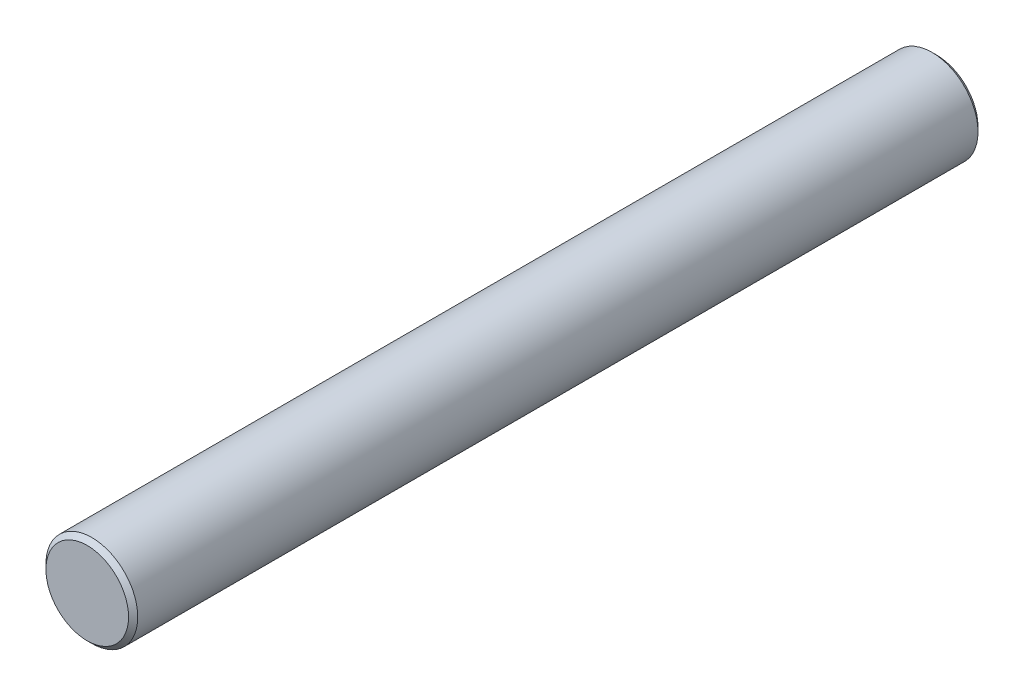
ISO-10303-21;
HEADER;
FILE_DESCRIPTION(('STEP AP214'),'2;1');
FILE_NAME('part.step','',(''),(''),'','','');
FILE_SCHEMA(('AUTOMOTIVE_DESIGN { 1 0 10303 214 1 1 1 1 }'));
ENDSEC;
DATA;
#1=APPLICATION_CONTEXT('core data for automotive mechanical design processes');
#2=APPLICATION_PROTOCOL_DEFINITION('international standard','automotive_design',2000,#1);
#3=PRODUCT_CONTEXT('',#1,'mechanical');
#4=PRODUCT('Part','Part','',(#3));
#5=PRODUCT_RELATED_PRODUCT_CATEGORY('part','',(#4));
#6=PRODUCT_DEFINITION_FORMATION('','',#4);
#7=PRODUCT_DEFINITION_CONTEXT('part definition',#1,'design');
#8=PRODUCT_DEFINITION('design','',#6,#7);
#9=PRODUCT_DEFINITION_SHAPE('','',#8);
#10=(LENGTH_UNIT() NAMED_UNIT(*) SI_UNIT(.MILLI.,.METRE.));
#11=(NAMED_UNIT(*) PLANE_ANGLE_UNIT() SI_UNIT($,.RADIAN.));
#12=(NAMED_UNIT(*) SI_UNIT($,.STERADIAN.) SOLID_ANGLE_UNIT());
#13=UNCERTAINTY_MEASURE_WITH_UNIT(LENGTH_MEASURE(1.E-05),#10,'distance_accuracy_value','');
#14=(GEOMETRIC_REPRESENTATION_CONTEXT(3) GLOBAL_UNCERTAINTY_ASSIGNED_CONTEXT((#13)) GLOBAL_UNIT_ASSIGNED_CONTEXT((#10,
#11,#12)) REPRESENTATION_CONTEXT('',''));
#15=CARTESIAN_POINT('',(0.,0.,0.));
#16=DIRECTION('',(0.,0.,1.));
#17=DIRECTION('',(1.,0.,0.));
#18=AXIS2_PLACEMENT_3D('',#15,#16,#17);
#19=CARTESIAN_POINT('',(0.,0.,9.25));
#20=DIRECTION('',(0.,0.,-1.));
#21=DIRECTION('',(-1.,0.,0.));
#22=AXIS2_PLACEMENT_3D('',#19,#20,#21);
#23=CYLINDRICAL_SURFACE('',#22,1.);
#24=CARTESIAN_POINT('',(0.,0.,-9.15));
#25=DIRECTION('',(0.,0.,1.));
#26=DIRECTION('',(1.,0.,0.));
#27=AXIS2_PLACEMENT_3D('',#24,#25,#26);
#28=CIRCLE('',#27,1.);
#29=CARTESIAN_POINT('',(1.,0.,-9.15));
#30=VERTEX_POINT('',#29);
#31=EDGE_CURVE('E38',#30,#30,#28,.T.);
#32=ORIENTED_EDGE('',*,*,#31,.T.);
#33=EDGE_LOOP('',(#32));
#34=FACE_BOUND('',#33,.T.);
#35=CARTESIAN_POINT('',(0.,0.,9.15));
#36=DIRECTION('',(0.,0.,1.));
#37=DIRECTION('',(1.,0.,0.));
#38=AXIS2_PLACEMENT_3D('',#35,#36,#37);
#39=CIRCLE('',#38,1.);
#40=CARTESIAN_POINT('',(1.,0.,9.15));
#41=VERTEX_POINT('',#40);
#42=EDGE_CURVE('E42',#41,#41,#39,.F.);
#43=ORIENTED_EDGE('',*,*,#42,.T.);
#44=EDGE_LOOP('',(#43));
#45=FACE_BOUND('',#44,.T.);
#46=ADVANCED_FACE('F28',(#34,#45),#23,.T.);
#47=CARTESIAN_POINT('',(0.,0.,9.25));
#48=DIRECTION('',(0.,0.,1.));
#49=DIRECTION('',(1.,0.,0.));
#50=AXIS2_PLACEMENT_3D('',#47,#48,#49);
#51=PLANE('',#50);
#52=CARTESIAN_POINT('',(0.,0.,9.25));
#53=DIRECTION('',(0.,0.,1.));
#54=DIRECTION('',(1.,0.,0.));
#55=AXIS2_PLACEMENT_3D('',#52,#53,#54);
#56=CIRCLE('',#55,0.900000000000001);
#57=CARTESIAN_POINT('',(0.900000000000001,0.,9.25));
#58=VERTEX_POINT('',#57);
#59=EDGE_CURVE('E10',#58,#58,#56,.T.);
#60=ORIENTED_EDGE('',*,*,#59,.T.);
#61=EDGE_LOOP('',(#60));
#62=FACE_BOUND('',#61,.T.);
#63=ADVANCED_FACE('F61',(#62),#51,.T.);
#64=CARTESIAN_POINT('',(0.,0.,-9.25));
#65=DIRECTION('',(0.,0.,1.));
#66=DIRECTION('',(1.,0.,0.));
#67=AXIS2_PLACEMENT_3D('',#64,#65,#66);
#68=PLANE('',#67);
#69=CARTESIAN_POINT('',(0.,0.,-9.25));
#70=DIRECTION('',(0.,0.,1.));
#71=DIRECTION('',(1.,0.,0.));
#72=AXIS2_PLACEMENT_3D('',#69,#70,#71);
#73=CIRCLE('',#72,0.9);
#74=CARTESIAN_POINT('',(0.9,0.,-9.25));
#75=VERTEX_POINT('',#74);
#76=EDGE_CURVE('E34',#75,#75,#73,.F.);
#77=ORIENTED_EDGE('',*,*,#76,.T.);
#78=EDGE_LOOP('',(#77));
#79=FACE_BOUND('',#78,.T.);
#80=ADVANCED_FACE('F57',(#79),#68,.F.);
#81=CARTESIAN_POINT('',(0.,0.,-9.15));
#82=DIRECTION('',(0.,0.,1.));
#83=DIRECTION('',(1.,0.,0.));
#84=AXIS2_PLACEMENT_3D('',#81,#82,#83);
#85=CONICAL_SURFACE('',#84,1.,0.785398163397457);
#86=ORIENTED_EDGE('',*,*,#76,.F.);
#87=EDGE_LOOP('',(#86));
#88=FACE_BOUND('',#87,.T.);
#89=ORIENTED_EDGE('',*,*,#31,.F.);
#90=EDGE_LOOP('',(#89));
#91=FACE_BOUND('',#90,.T.);
#92=ADVANCED_FACE('F52',(#88,#91),#85,.T.);
#93=CARTESIAN_POINT('',(0.,0.,9.25));
#94=DIRECTION('',(0.,0.,-1.));
#95=DIRECTION('',(-1.,0.,0.));
#96=AXIS2_PLACEMENT_3D('',#93,#94,#95);
#97=CONICAL_SURFACE('',#96,0.900000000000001,0.785398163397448);
#98=ORIENTED_EDGE('',*,*,#42,.F.);
#99=EDGE_LOOP('',(#98));
#100=FACE_BOUND('',#99,.T.);
#101=ORIENTED_EDGE('',*,*,#59,.F.);
#102=EDGE_LOOP('',(#101));
#103=FACE_BOUND('',#102,.T.);
#104=ADVANCED_FACE('F49',(#100,#103),#97,.T.);
#105=CLOSED_SHELL('',(#46,#63,#80,#92,#104));
#106=MANIFOLD_SOLID_BREP('B2',#105);
#107=ADVANCED_BREP_SHAPE_REPRESENTATION('',(#18,#106),#14);
#108=SHAPE_DEFINITION_REPRESENTATION(#9,#107);
ENDSEC;
END-ISO-10303-21;
